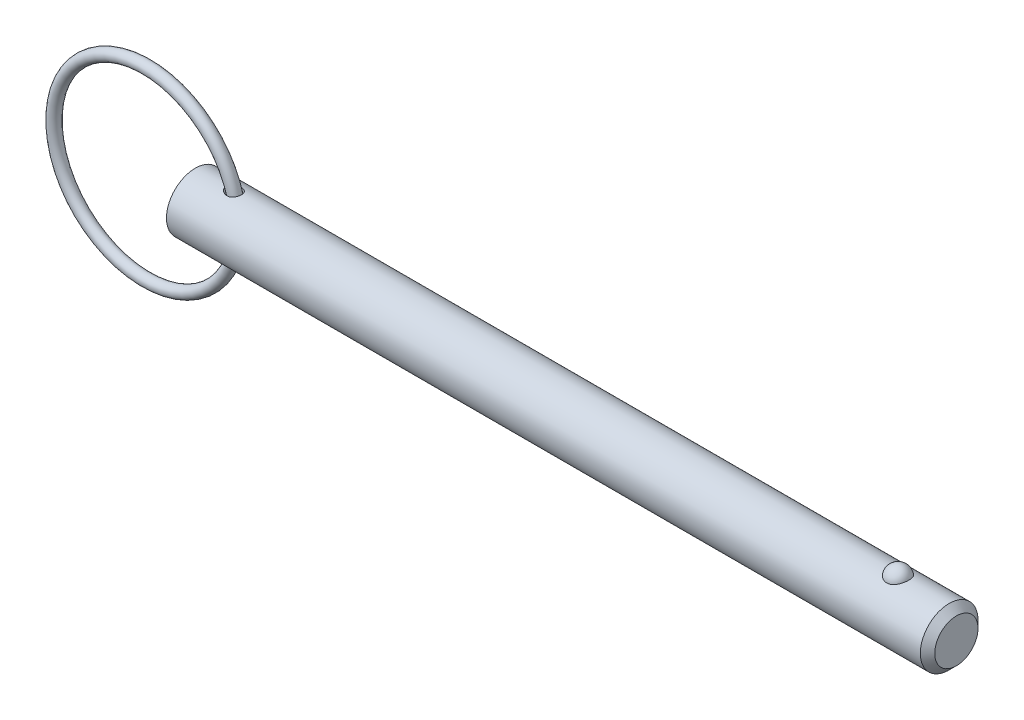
ISO-10303-21;
HEADER;
FILE_DESCRIPTION(('STEP AP214'),'2;1');
FILE_NAME('part.step','',(''),(''),'','','');
FILE_SCHEMA(('AUTOMOTIVE_DESIGN { 1 0 10303 214 1 1 1 1 }'));
ENDSEC;
DATA;
#1=APPLICATION_CONTEXT('core data for automotive mechanical design processes');
#2=APPLICATION_PROTOCOL_DEFINITION('international standard','automotive_design',2000,#1);
#3=PRODUCT_CONTEXT('',#1,'mechanical');
#4=PRODUCT('Part','Part','',(#3));
#5=PRODUCT_RELATED_PRODUCT_CATEGORY('part','',(#4));
#6=PRODUCT_DEFINITION_FORMATION('','',#4);
#7=PRODUCT_DEFINITION_CONTEXT('part definition',#1,'design');
#8=PRODUCT_DEFINITION('design','',#6,#7);
#9=PRODUCT_DEFINITION_SHAPE('','',#8);
#10=(LENGTH_UNIT() NAMED_UNIT(*) SI_UNIT(.MILLI.,.METRE.));
#11=(NAMED_UNIT(*) PLANE_ANGLE_UNIT() SI_UNIT($,.RADIAN.));
#12=(NAMED_UNIT(*) SI_UNIT($,.STERADIAN.) SOLID_ANGLE_UNIT());
#13=UNCERTAINTY_MEASURE_WITH_UNIT(LENGTH_MEASURE(1.E-05),#10,'distance_accuracy_value','');
#14=(GEOMETRIC_REPRESENTATION_CONTEXT(3) GLOBAL_UNCERTAINTY_ASSIGNED_CONTEXT((#13)) GLOBAL_UNIT_ASSIGNED_CONTEXT((#10,
#11,#12)) REPRESENTATION_CONTEXT('',''));
#15=CARTESIAN_POINT('',(0.,0.,0.));
#16=DIRECTION('',(0.,0.,1.));
#17=DIRECTION('',(1.,0.,0.));
#18=AXIS2_PLACEMENT_3D('',#15,#16,#17);
#19=CARTESIAN_POINT('',(-6.75433730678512,0.,0.));
#20=DIRECTION('',(0.,0.,1.));
#21=DIRECTION('',(1.,0.,0.));
#22=AXIS2_PLACEMENT_3D('',#19,#20,#21);
#23=TOROIDAL_SURFACE('',#22,12.7,0.794);
#24=CARTESIAN_POINT('',(6.73966269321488,0.,0.));
#25=VERTEX_POINT('',#24);
#26=VERTEX_LOOP('',#25);
#27=FACE_BOUND('',#26,.T.);
#28=ADVANCED_FACE('P0_F12',(#27),#23,.T.);
#29=CLOSED_SHELL('',(#28));
#30=MANIFOLD_SOLID_BREP('P0_B1',#29);
#31=CARTESIAN_POINT('',(0.,0.,0.));
#32=DIRECTION('',(1.,0.,0.));
#33=DIRECTION('',(0.,0.,-1.));
#34=AXIS2_PLACEMENT_3D('',#31,#32,#33);
#35=CYLINDRICAL_SURFACE('',#34,3.97);
#36=CARTESIAN_POINT('',(4.47423598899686,3.9272127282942,-0.581291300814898));
#37=CARTESIAN_POINT('',(4.51402362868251,3.92000695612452,-0.62997219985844));
#38=CARTESIAN_POINT('',(4.55825642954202,3.91241085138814,-0.675032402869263));
#39=CARTESIAN_POINT('',(4.65378532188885,3.8973704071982,-0.757069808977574));
#40=CARTESIAN_POINT('',(4.70509780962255,3.88992646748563,-0.794027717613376));
#41=CARTESIAN_POINT('',(4.81300878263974,3.87608600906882,-0.859045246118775));
#42=CARTESIAN_POINT('',(4.86959180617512,3.86968656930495,-0.887129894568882));
#43=CARTESIAN_POINT('',(4.98666757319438,3.85867771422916,-0.933854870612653));
#44=CARTESIAN_POINT('',(5.04715829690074,3.85406738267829,-0.952500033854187));
#45=CARTESIAN_POINT('',(5.17222686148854,3.84716625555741,-0.980011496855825));
#46=CARTESIAN_POINT('',(5.23687124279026,3.84494236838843,-0.988596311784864));
#47=CARTESIAN_POINT('',(5.36671178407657,3.84347581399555,-0.994286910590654));
#48=CARTESIAN_POINT('',(5.43190770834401,3.84423193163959,-0.991397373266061));
#49=CARTESIAN_POINT('',(5.5560514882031,3.84859691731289,-0.974304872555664));
#50=CARTESIAN_POINT('',(5.61511712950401,3.85200226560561,-0.960908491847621));
#51=CARTESIAN_POINT('',(5.72974412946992,3.8610605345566,-0.923836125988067));
#52=CARTESIAN_POINT('',(5.78530708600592,3.86671242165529,-0.90016486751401));
#53=CARTESIAN_POINT('',(5.88712740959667,3.87908259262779,-0.845190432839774));
#54=CARTESIAN_POINT('',(5.93376792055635,3.88569301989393,-0.814569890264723));
#55=CARTESIAN_POINT('',(6.02101503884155,3.89947732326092,-0.745789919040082));
#56=CARTESIAN_POINT('',(6.06162229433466,3.90665113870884,-0.707631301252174));
#57=CARTESIAN_POINT('',(6.13496290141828,3.9206013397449,-0.625680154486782));
#58=CARTESIAN_POINT('',(6.16783367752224,3.92738273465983,-0.582011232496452));
#59=CARTESIAN_POINT('',(6.2258925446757,3.93995609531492,-0.489706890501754));
#60=CARTESIAN_POINT('',(6.25108046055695,3.94574803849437,-0.441071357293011));
#61=CARTESIAN_POINT('',(6.29336449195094,3.95576358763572,-0.339770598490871));
#62=CARTESIAN_POINT('',(6.31039150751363,3.95997373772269,-0.28707520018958));
#63=CARTESIAN_POINT('',(6.33565624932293,3.96630600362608,-0.179496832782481));
#64=CARTESIAN_POINT('',(6.34389366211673,3.96842804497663,-0.124613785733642));
#65=CARTESIAN_POINT('',(6.35142037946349,3.97036465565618,-0.0138440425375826));
#66=CARTESIAN_POINT('',(6.35065227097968,3.97016441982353,0.0420468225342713));
#67=CARTESIAN_POINT('',(6.34004566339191,3.96744188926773,0.152904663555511));
#68=CARTESIAN_POINT('',(6.33020697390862,3.96491954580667,0.207871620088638));
#69=CARTESIAN_POINT('',(6.30166659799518,3.95782104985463,0.315369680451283));
#70=CARTESIAN_POINT('',(6.28295698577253,3.95324306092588,0.36789855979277));
#71=CARTESIAN_POINT('',(6.23710200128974,3.94253162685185,0.468965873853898));
#72=CARTESIAN_POINT('',(6.20995670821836,3.93639819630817,0.517504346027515));
#73=CARTESIAN_POINT('',(6.14798638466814,3.92327702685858,0.609041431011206));
#74=CARTESIAN_POINT('',(6.11318666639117,3.91629213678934,0.652057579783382));
#75=CARTESIAN_POINT('',(6.03675089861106,3.90223639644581,0.731492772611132));
#76=CARTESIAN_POINT('',(5.99511563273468,3.89516555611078,0.767912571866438));
#77=CARTESIAN_POINT('',(5.90657479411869,3.88180215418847,0.832828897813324));
#78=CARTESIAN_POINT('',(5.85972260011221,3.87550288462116,0.86139687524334));
#79=CARTESIAN_POINT('',(5.76177854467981,3.86429747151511,0.910350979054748));
#80=CARTESIAN_POINT('',(5.71068697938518,3.8593912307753,0.930737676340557));
#81=CARTESIAN_POINT('',(5.60571987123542,3.85147434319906,0.962976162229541));
#82=CARTESIAN_POINT('',(5.55184284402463,3.84846471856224,0.974823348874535));
#83=CARTESIAN_POINT('',(5.44283210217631,3.84460058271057,0.989953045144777));
#84=CARTESIAN_POINT('',(5.38769814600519,3.84374648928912,0.99323389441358));
#85=CARTESIAN_POINT('',(5.27524330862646,3.84420584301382,0.991454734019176));
#86=CARTESIAN_POINT('',(5.21792896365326,3.84561285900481,0.986034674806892));
#87=CARTESIAN_POINT('',(5.1048579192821,3.85052758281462,0.966661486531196));
#88=CARTESIAN_POINT('',(5.04910180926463,3.85403607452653,0.952705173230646));
#89=CARTESIAN_POINT('',(4.93593174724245,3.86308835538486,0.915340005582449));
#90=CARTESIAN_POINT('',(4.8787523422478,3.86877458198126,0.891254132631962));
#91=CARTESIAN_POINT('',(4.7690169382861,3.88143650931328,0.83438431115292));
#92=CARTESIAN_POINT('',(4.71646372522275,3.88841297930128,0.801595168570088));
#93=CARTESIAN_POINT('',(4.61492504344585,3.90324173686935,0.726056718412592));
#94=CARTESIAN_POINT('',(4.56625259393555,3.91112043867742,0.682888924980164));
#95=CARTESIAN_POINT('',(4.47749220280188,3.92644930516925,0.588370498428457));
#96=CARTESIAN_POINT('',(4.43740132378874,3.93389961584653,0.537022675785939));
#97=CARTESIAN_POINT('',(4.37035516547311,3.94686586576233,0.431042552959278));
#98=CARTESIAN_POINT('',(4.34268823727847,3.95247934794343,0.376876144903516));
#99=CARTESIAN_POINT('',(4.29855851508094,3.96161331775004,0.264011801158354));
#100=CARTESIAN_POINT('',(4.28207681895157,3.96513733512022,0.20532169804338));
#101=CARTESIAN_POINT('',(4.26319409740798,3.96919493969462,0.094762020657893));
#102=CARTESIAN_POINT('',(4.25904206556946,3.97009986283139,0.0432014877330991));
#103=CARTESIAN_POINT('',(4.26004223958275,3.9698827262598,-0.0598293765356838));
#104=CARTESIAN_POINT('',(4.26519288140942,3.96876100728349,-0.111299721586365));
#105=CARTESIAN_POINT('',(4.28369027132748,3.96479623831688,-0.208517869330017));
#106=CARTESIAN_POINT('',(4.29637416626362,3.96209263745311,-0.25440084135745));
#107=CARTESIAN_POINT('',(4.32867922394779,3.95536287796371,-0.343510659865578));
#108=CARTESIAN_POINT('',(4.34829584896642,3.95133758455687,-0.386739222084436));
#109=CARTESIAN_POINT('',(4.38573190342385,3.94389838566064,-0.455314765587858));
#110=CARTESIAN_POINT('',(4.40181371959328,3.94075686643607,-0.481662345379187));
#111=CARTESIAN_POINT('',(4.43632024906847,3.93417901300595,-0.532726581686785));
#112=CARTESIAN_POINT('',(4.45474473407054,3.93074270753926,-0.557443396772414));
#113=CARTESIAN_POINT('',(4.47423598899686,3.9272127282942,-0.581291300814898));
#114=B_SPLINE_CURVE_WITH_KNOTS('',3,(#36,#37,#38,#39,#40,#41,#42,#43,#44,#45,#46,#47,#48,#49,
#50,#51,#52,#53,#54,#55,#56,#57,#58,#59,#60,#61,#62,#63,#64,#65,#66,#67,#68,#69,#70,#71,#72,#73,
#74,#75,#76,#77,#78,#79,#80,#81,#82,#83,#84,#85,#86,#87,#88,#89,#90,#91,#92,#93,#94,#95,#96,#97,
#98,#99,#100,#101,#102,#103,#104,#105,#106,#107,#108,#109,#110,#111,#112,#113),.UNSPECIFIED.,
.T.,.F.,(4,2,2,2,2,2,2,2,2,2,2,2,2,2,2,2,2,2,2,2,2,2,2,2,2,2,2,2,2,2,2,2,2,2,2,2,2,2,4),(0.,
0.189730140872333,0.379907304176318,0.569543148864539,0.759081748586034,0.953805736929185,
1.148450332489,1.32946176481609,1.51039001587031,1.67812095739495,1.84583386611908,
2.01029437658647,2.17475863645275,2.34059186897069,2.50643101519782,2.67332801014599,
2.84022850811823,3.00727840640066,3.17432673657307,3.34083074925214,3.50731568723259,
3.67223129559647,3.83713539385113,4.00212829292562,4.16715316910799,4.33918465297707,
4.5112803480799,4.69738596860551,4.88360290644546,5.07919911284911,5.27472826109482,
5.45686425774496,5.63869168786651,5.79305070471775,5.94738377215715,6.08981233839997,
6.2321478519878,6.3251023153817,6.4180477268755),.UNSPECIFIED.);
#115=CARTESIAN_POINT('',(4.47423598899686,3.9272127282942,-0.581291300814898));
#116=VERTEX_POINT('',#115);
#117=EDGE_CURVE('P1_E40',#116,#116,#114,.T.);
#118=ORIENTED_EDGE('',*,*,#117,.T.);
#119=EDGE_LOOP('',(#118));
#120=FACE_BOUND('',#119,.T.);
#121=CARTESIAN_POINT('',(103.7875,0.,0.));
#122=DIRECTION('',(1.,0.,0.));
#123=DIRECTION('',(0.,0.,-1.));
#124=AXIS2_PLACEMENT_3D('',#121,#122,#123);
#125=CIRCLE('',#124,3.97);
#126=CARTESIAN_POINT('',(103.7875,0.,-3.97));
#127=VERTEX_POINT('',#126);
#128=EDGE_CURVE('P1_E25',#127,#127,#125,.T.);
#129=ORIENTED_EDGE('',*,*,#128,.F.);
#130=EDGE_LOOP('',(#129));
#131=FACE_BOUND('',#130,.T.);
#132=CARTESIAN_POINT('',(0.,0.,0.));
#133=DIRECTION('',(1.,0.,0.));
#134=DIRECTION('',(0.,0.,-1.));
#135=AXIS2_PLACEMENT_3D('',#132,#133,#134);
#136=CIRCLE('',#135,3.97);
#137=CARTESIAN_POINT('',(0.,0.,-3.97));
#138=VERTEX_POINT('',#137);
#139=EDGE_CURVE('P1_E9',#138,#138,#136,.T.);
#140=ORIENTED_EDGE('',*,*,#139,.T.);
#141=EDGE_LOOP('',(#140));
#142=FACE_BOUND('',#141,.T.);
#143=CARTESIAN_POINT('',(96.7451922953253,3.65715365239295,1.5447094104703));
#144=CARTESIAN_POINT('',(96.6652448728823,3.65716001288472,1.54470290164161));
#145=CARTESIAN_POINT('',(96.5851650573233,3.65987074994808,1.53832549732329));
#146=CARTESIAN_POINT('',(96.4272374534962,3.6704221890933,1.51297018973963));
#147=CARTESIAN_POINT('',(96.3493961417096,3.67827646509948,1.49395894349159));
#148=CARTESIAN_POINT('',(96.1984614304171,3.69818848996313,1.4439595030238));
#149=CARTESIAN_POINT('',(96.1253560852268,3.71023513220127,1.41300293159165));
#150=CARTESIAN_POINT('',(95.9855630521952,3.7372183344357,1.34000212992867));
#151=CARTESIAN_POINT('',(95.9188725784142,3.75215363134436,1.29796274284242));
#152=CARTESIAN_POINT('',(95.79148864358,3.78384968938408,1.20248834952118));
#153=CARTESIAN_POINT('',(95.7310299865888,3.80065129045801,1.14875388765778));
#154=CARTESIAN_POINT('',(95.6196942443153,3.83398532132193,1.03205417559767));
#155=CARTESIAN_POINT('',(95.5688200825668,3.85051766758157,0.969086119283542));
#156=CARTESIAN_POINT('',(95.4756321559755,3.88238608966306,0.832526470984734));
#157=CARTESIAN_POINT('',(95.4337961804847,3.89763698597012,0.758588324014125));
#158=CARTESIAN_POINT('',(95.3625108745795,3.92451063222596,0.604352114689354));
#159=CARTESIAN_POINT('',(95.3330623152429,3.93613315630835,0.52405365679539));
#160=CARTESIAN_POINT('',(95.2868927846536,3.95467606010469,0.358403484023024));
#161=CARTESIAN_POINT('',(95.2703127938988,3.96154426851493,0.273006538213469));
#162=CARTESIAN_POINT('',(95.250756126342,3.96967008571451,0.100408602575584));
#163=CARTESIAN_POINT('',(95.2477789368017,3.97092790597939,0.013207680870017));
#164=CARTESIAN_POINT('',(95.2554587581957,3.96771794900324,-0.159844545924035));
#165=CARTESIAN_POINT('',(95.2660164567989,3.96329187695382,-0.245701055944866));
#166=CARTESIAN_POINT('',(95.3003800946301,3.94923163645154,-0.41427746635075));
#167=CARTESIAN_POINT('',(95.3241862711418,3.93959737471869,-0.496997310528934));
#168=CARTESIAN_POINT('',(95.3846114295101,3.91607752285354,-0.657113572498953));
#169=CARTESIAN_POINT('',(95.4212495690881,3.90218558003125,-0.734501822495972));
#170=CARTESIAN_POINT('',(95.5065935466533,3.87158287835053,-0.881704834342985));
#171=CARTESIAN_POINT('',(95.5553004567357,3.8548718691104,-0.951518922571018));
#172=CARTESIAN_POINT('',(95.6641161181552,3.82028735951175,-1.08208159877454));
#173=CARTESIAN_POINT('',(95.7242955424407,3.80240713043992,-1.14276958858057));
#174=CARTESIAN_POINT('',(95.854493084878,3.76758161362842,-1.2528243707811));
#175=CARTESIAN_POINT('',(95.9245105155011,3.75063626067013,-1.30219195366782));
#176=CARTESIAN_POINT('',(96.07118160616,3.71998948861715,-1.38729709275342));
#177=CARTESIAN_POINT('',(96.1476813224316,3.70623183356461,-1.42327904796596));
#178=CARTESIAN_POINT('',(96.3062981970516,3.68323188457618,-1.48178996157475));
#179=CARTESIAN_POINT('',(96.3884132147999,3.67398788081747,-1.50432401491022));
#180=CARTESIAN_POINT('',(96.5514810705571,3.6615216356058,-1.53440939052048));
#181=CARTESIAN_POINT('',(96.6322840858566,3.65801951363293,-1.54265826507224));
#182=CARTESIAN_POINT('',(96.7942085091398,3.65657341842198,-1.54608423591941));
#183=CARTESIAN_POINT('',(96.8753298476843,3.65862829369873,-1.5412640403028));
#184=CARTESIAN_POINT('',(97.0328122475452,3.66788969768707,-1.51908474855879));
#185=CARTESIAN_POINT('',(97.1092422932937,3.67492621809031,-1.50213925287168));
#186=CARTESIAN_POINT('',(97.2580412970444,3.69318404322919,-1.4566698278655));
#187=CARTESIAN_POINT('',(97.3304099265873,3.7044056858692,-1.42814496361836));
#188=CARTESIAN_POINT('',(97.4708029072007,3.73012749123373,-1.35956319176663));
#189=CARTESIAN_POINT('',(97.5387000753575,3.74469307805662,-1.31927107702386));
#190=CARTESIAN_POINT('',(97.6668649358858,3.77545272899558,-1.22847440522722));
#191=CARTESIAN_POINT('',(97.7271308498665,3.79164717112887,-1.17796747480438));
#192=CARTESIAN_POINT('',(97.8416346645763,3.82490325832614,-1.06519260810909));
#193=CARTESIAN_POINT('',(97.8954137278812,3.84196735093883,-1.00245914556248));
#194=CARTESIAN_POINT('',(97.9920988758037,3.87439863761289,-0.86871586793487));
#195=CARTESIAN_POINT('',(98.0350030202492,3.88976552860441,-0.79770457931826));
#196=CARTESIAN_POINT('',(98.110266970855,3.91771381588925,-0.646896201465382));
#197=CARTESIAN_POINT('',(98.1422532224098,3.93019255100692,-0.566893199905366));
#198=CARTESIAN_POINT('',(98.1931101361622,3.95043886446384,-0.402255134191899));
#199=CARTESIAN_POINT('',(98.2119807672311,3.95820643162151,-0.31762005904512));
#200=CARTESIAN_POINT('',(98.2362162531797,3.96823733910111,-0.146156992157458));
#201=CARTESIAN_POINT('',(98.2415874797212,3.970503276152,-0.0593300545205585));
#202=CARTESIAN_POINT('',(98.2387309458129,3.96930811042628,0.114057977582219));
#203=CARTESIAN_POINT('',(98.2305035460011,3.9658471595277,0.200619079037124));
#204=CARTESIAN_POINT('',(98.2007063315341,3.95358562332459,0.370506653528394));
#205=CARTESIAN_POINT('',(98.1792129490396,3.94481563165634,0.453848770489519));
#206=CARTESIAN_POINT('',(98.1233839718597,3.92284586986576,0.615497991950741));
#207=CARTESIAN_POINT('',(98.0890474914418,3.90964579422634,0.69380474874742));
#208=CARTESIAN_POINT('',(98.0079702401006,3.88006987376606,0.843703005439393));
#209=CARTESIAN_POINT('',(97.9611536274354,3.86367478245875,0.915249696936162));
#210=CARTESIAN_POINT('',(97.8561897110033,3.82949741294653,1.04910810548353));
#211=CARTESIAN_POINT('',(97.7980428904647,3.81171519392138,1.1114202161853));
#212=CARTESIAN_POINT('',(97.6717433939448,3.77673366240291,1.22503948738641));
#213=CARTESIAN_POINT('',(97.6035970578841,3.75953398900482,1.27635357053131));
#214=CARTESIAN_POINT('',(97.4589009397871,3.72770506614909,1.36653336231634));
#215=CARTESIAN_POINT('',(97.382348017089,3.7130767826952,1.40539439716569));
#216=CARTESIAN_POINT('',(97.2257594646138,3.68864287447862,1.46830480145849));
#217=CARTESIAN_POINT('',(97.1459307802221,3.67869017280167,1.49281289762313));
#218=CARTESIAN_POINT('',(96.9829877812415,3.66414535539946,1.52817474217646));
#219=CARTESIAN_POINT('',(96.8998840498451,3.65953723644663,1.53906926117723));
#220=CARTESIAN_POINT('',(96.7927760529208,3.6573894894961,1.54414878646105));
#221=CARTESIAN_POINT('',(96.7689900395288,3.65715175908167,1.54471134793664));
#222=CARTESIAN_POINT('',(96.7451922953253,3.65715365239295,1.5447094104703));
#223=B_SPLINE_CURVE_WITH_KNOTS('',3,(#143,#144,#145,#146,#147,#148,#149,#150,#151,#152,#153,
#154,#155,#156,#157,#158,#159,#160,#161,#162,#163,#164,#165,#166,#167,#168,#169,#170,#171,#172,
#173,#174,#175,#176,#177,#178,#179,#180,#181,#182,#183,#184,#185,#186,#187,#188,#189,#190,#191,
#192,#193,#194,#195,#196,#197,#198,#199,#200,#201,#202,#203,#204,#205,#206,#207,#208,#209,#210,
#211,#212,#213,#214,#215,#216,#217,#218,#219,#220,#221,#222),.UNSPECIFIED.,.T.,.F.,(4,2,2,2,2,2,
2,2,2,2,2,2,2,2,2,2,2,2,2,2,2,2,2,2,2,2,2,2,2,2,2,2,2,2,2,2,2,2,2,4),(0.,0.239777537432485,
0.480190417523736,0.719971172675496,0.9596473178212,1.20639040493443,1.45320863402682,
1.71093679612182,1.9686809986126,2.22921052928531,2.48973023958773,2.74834928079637,
3.00697295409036,3.26598440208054,3.52501886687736,3.78570385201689,4.04637062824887,
4.30201257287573,4.55755760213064,4.80022994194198,5.04285200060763,5.27757006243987,
5.51230707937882,5.7521012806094,5.99195126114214,6.24392810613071,6.49594987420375,
6.75588818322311,7.01582710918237,7.27564332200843,7.5354526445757,7.79377886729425,
8.05212290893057,8.31207418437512,8.57201437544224,8.83179046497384,9.09166393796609,
9.34270057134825,9.59298357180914,9.66435753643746),.UNSPECIFIED.);
#224=CARTESIAN_POINT('',(96.7451922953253,3.65715365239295,1.5447094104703));
#225=VERTEX_POINT('',#224);
#226=EDGE_CURVE('P1_E34',#225,#225,#223,.T.);
#227=ORIENTED_EDGE('',*,*,#226,.T.);
#228=EDGE_LOOP('',(#227));
#229=FACE_BOUND('',#228,.T.);
#230=CARTESIAN_POINT('',(4.47423598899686,-3.9272127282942,-0.581291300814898));
#231=CARTESIAN_POINT('',(4.44128910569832,-3.93317954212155,-0.540978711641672));
#232=CARTESIAN_POINT('',(4.41136828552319,-3.93888228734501,-0.498159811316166));
#233=CARTESIAN_POINT('',(4.35872676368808,-3.94921939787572,-0.408179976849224));
#234=CARTESIAN_POINT('',(4.33600082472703,-3.95385453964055,-0.36102223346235));
#235=CARTESIAN_POINT('',(4.29878526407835,-3.9615772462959,-0.263108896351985));
#236=CARTESIAN_POINT('',(4.28434166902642,-3.96465615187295,-0.212334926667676));
#237=CARTESIAN_POINT('',(4.26481927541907,-3.96884157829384,-0.108934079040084));
#238=CARTESIAN_POINT('',(4.25973608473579,-3.96994902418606,-0.0563080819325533));
#239=CARTESIAN_POINT('',(4.25930094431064,-3.97004379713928,0.0449240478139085));
#240=CARTESIAN_POINT('',(4.26323134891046,-3.96918747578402,0.0935283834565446));
#241=CARTESIAN_POINT('',(4.27911923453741,-3.96577236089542,0.189336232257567));
#242=CARTESIAN_POINT('',(4.29107713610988,-3.96321347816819,0.236539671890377));
#243=CARTESIAN_POINT('',(4.3222019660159,-3.95670052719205,0.327873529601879));
#244=CARTESIAN_POINT('',(4.34129939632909,-3.95275993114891,0.37202886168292));
#245=CARTESIAN_POINT('',(4.38584298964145,-3.94385347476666,0.456884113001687));
#246=CARTESIAN_POINT('',(4.41129114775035,-3.93888729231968,0.497582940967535));
#247=CARTESIAN_POINT('',(4.47067915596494,-3.92777410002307,0.57910486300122));
#248=CARTESIAN_POINT('',(4.50523982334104,-3.92155746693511,0.61946509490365));
#249=CARTESIAN_POINT('',(4.57989786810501,-3.90894004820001,0.694653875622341));
#250=CARTESIAN_POINT('',(4.61999845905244,-3.90253915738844,0.729479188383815));
#251=CARTESIAN_POINT('',(4.7106931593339,-3.88921622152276,0.79766500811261));
#252=CARTESIAN_POINT('',(4.76196990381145,-3.88234748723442,0.830130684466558));
#253=CARTESIAN_POINT('',(4.86907659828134,-3.86980743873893,0.886754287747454));
#254=CARTESIAN_POINT('',(4.92490895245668,-3.86413676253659,0.91090779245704));
#255=CARTESIAN_POINT('',(5.04387274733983,-3.85430959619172,0.951667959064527));
#256=CARTESIAN_POINT('',(5.10724127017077,-3.85028805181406,0.967622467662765));
#257=CARTESIAN_POINT('',(5.23589558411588,-3.84499084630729,0.988466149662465));
#258=CARTESIAN_POINT('',(5.30118075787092,-3.84371431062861,0.993358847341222));
#259=CARTESIAN_POINT('',(5.42870419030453,-3.84421020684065,0.991437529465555));
#260=CARTESIAN_POINT('',(5.49094970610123,-3.84585050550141,0.985130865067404));
#261=CARTESIAN_POINT('',(5.61317445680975,-3.85182888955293,0.961489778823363));
#262=CARTESIAN_POINT('',(5.67315499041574,-3.85616540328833,0.944161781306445));
#263=CARTESIAN_POINT('',(5.78385047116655,-3.86655540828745,0.900611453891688));
#264=CARTESIAN_POINT('',(5.83492113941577,-3.87243611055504,0.875248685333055));
#265=CARTESIAN_POINT('',(5.93173444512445,-3.88533932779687,0.816058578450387));
#266=CARTESIAN_POINT('',(5.97747806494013,-3.89236163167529,0.78223280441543));
#267=CARTESIAN_POINT('',(6.06067538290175,-3.90644082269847,0.708499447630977));
#268=CARTESIAN_POINT('',(6.09837515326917,-3.9134865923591,0.668866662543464));
#269=CARTESIAN_POINT('',(6.16659675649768,-3.92708124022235,0.583768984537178));
#270=CARTESIAN_POINT('',(6.19711866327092,-3.93363012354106,0.538304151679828));
#271=CARTESIAN_POINT('',(6.25033980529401,-3.94554016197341,0.44265233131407));
#272=CARTESIAN_POINT('',(6.27301093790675,-3.95089702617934,0.392449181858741));
#273=CARTESIAN_POINT('',(6.3098605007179,-3.95981777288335,0.288866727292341));
#274=CARTESIAN_POINT('',(6.32403857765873,-3.96338158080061,0.235487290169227));
#275=CARTESIAN_POINT('',(6.34366897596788,-3.96835894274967,0.126579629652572));
#276=CARTESIAN_POINT('',(6.34904619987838,-3.9697539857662,0.0710370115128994));
#277=CARTESIAN_POINT('',(6.35072157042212,-3.97018611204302,-0.0401947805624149));
#278=CARTESIAN_POINT('',(6.34701950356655,-3.96922313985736,-0.0958839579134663));
#279=CARTESIAN_POINT('',(6.33059893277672,-3.96503727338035,-0.205963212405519));
#280=CARTESIAN_POINT('',(6.31785949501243,-3.96180913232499,-0.260349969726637));
#281=CARTESIAN_POINT('',(6.28362857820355,-3.95343617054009,-0.366141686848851));
#282=CARTESIAN_POINT('',(6.26213701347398,-3.94829133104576,-0.417546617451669));
#283=CARTESIAN_POINT('',(6.21094198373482,-3.93665740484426,-0.515825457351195));
#284=CARTESIAN_POINT('',(6.18125109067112,-3.93017037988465,-0.562706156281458));
#285=CARTESIAN_POINT('',(6.11437296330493,-3.91656890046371,-0.650670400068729));
#286=CARTESIAN_POINT('',(6.07718632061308,-3.90945449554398,-0.691754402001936));
#287=CARTESIAN_POINT('',(5.99660825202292,-3.89545704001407,-0.76665430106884));
#288=CARTESIAN_POINT('',(5.95326700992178,-3.88857262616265,-0.800523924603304));
#289=CARTESIAN_POINT('',(5.86137696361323,-3.87574946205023,-0.860470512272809));
#290=CARTESIAN_POINT('',(5.81282877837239,-3.86981059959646,-0.886548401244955));
#291=CARTESIAN_POINT('',(5.71225875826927,-3.85955823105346,-0.93016771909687));
#292=CARTESIAN_POINT('',(5.6602610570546,-3.85523459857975,-0.947762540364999));
#293=CARTESIAN_POINT('',(5.55400860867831,-3.84858369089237,-0.974419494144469));
#294=CARTESIAN_POINT('',(5.49975362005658,-3.84625662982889,-0.983480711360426));
#295=CARTESIAN_POINT('',(5.38905619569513,-3.84373902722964,-0.99327593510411));
#296=CARTESIAN_POINT('',(5.33259335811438,-3.8436048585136,-0.993790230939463));
#297=CARTESIAN_POINT('',(5.22028568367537,-3.84553679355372,-0.986285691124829));
#298=CARTESIAN_POINT('',(5.16444101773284,-3.84760349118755,-0.978264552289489));
#299=CARTESIAN_POINT('',(5.05063804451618,-3.85386728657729,-0.953301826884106));
#300=CARTESIAN_POINT('',(4.99282059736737,-3.85820814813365,-0.935754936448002));
#301=CARTESIAN_POINT('',(4.88067115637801,-3.86855108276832,-0.89202836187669));
#302=CARTESIAN_POINT('',(4.82634209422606,-3.87455453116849,-0.865841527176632));
#303=CARTESIAN_POINT('',(4.71735796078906,-3.8882057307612,-0.802439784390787));
#304=CARTESIAN_POINT('',(4.66319676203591,-3.89595714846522,-0.764393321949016));
#305=CARTESIAN_POINT('',(4.5624904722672,-3.9116844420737,-0.679328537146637));
#306=CARTESIAN_POINT('',(4.51593909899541,-3.9196601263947,-0.632317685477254));
#307=CARTESIAN_POINT('',(4.47423598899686,-3.9272127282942,-0.581291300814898));
#308=B_SPLINE_CURVE_WITH_KNOTS('',3,(#230,#231,#232,#233,#234,#235,#236,#237,#238,#239,#240,
#241,#242,#243,#244,#245,#246,#247,#248,#249,#250,#251,#252,#253,#254,#255,#256,#257,#258,#259,
#260,#261,#262,#263,#264,#265,#266,#267,#268,#269,#270,#271,#272,#273,#274,#275,#276,#277,#278,
#279,#280,#281,#282,#283,#284,#285,#286,#287,#288,#289,#290,#291,#292,#293,#294,#295,#296,#297,
#298,#299,#300,#301,#302,#303,#304,#305,#306,#307),.UNSPECIFIED.,.T.,.F.,(4,2,2,2,2,2,2,2,2,2,2,
2,2,2,2,2,2,2,2,2,2,2,2,2,2,2,2,2,2,2,2,2,2,2,2,2,2,2,4),(0.,0.157032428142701,
0.313950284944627,0.47173191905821,0.629439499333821,0.775030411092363,0.920628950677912,
1.06484561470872,1.20910764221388,1.36897610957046,1.5289377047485,1.71139614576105,
1.89395150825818,2.08937788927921,2.28474199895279,2.4714801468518,2.65810954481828,
2.82921764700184,3.00029414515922,3.16497190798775,3.32964797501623,3.49490756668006,
3.66017403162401,3.82684349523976,3.99351687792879,4.16057760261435,4.3276399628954,
4.49444757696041,4.66124203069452,4.82674719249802,4.99223270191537,5.15666259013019,
5.32111011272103,5.48977863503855,5.6584926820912,5.83945443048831,6.02056632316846,
6.21949800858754,6.41826462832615),.UNSPECIFIED.);
#309=CARTESIAN_POINT('',(4.47423598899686,-3.9272127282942,-0.581291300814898));
#310=VERTEX_POINT('',#309);
#311=EDGE_CURVE('P1_E17',#310,#310,#308,.T.);
#312=ORIENTED_EDGE('',*,*,#311,.T.);
#313=EDGE_LOOP('',(#312));
#314=FACE_BOUND('',#313,.T.);
#315=ADVANCED_FACE('P1_F13',(#120,#131,#142,#229,#314),#35,.T.);
#316=CARTESIAN_POINT('',(0.,0.,0.));
#317=DIRECTION('',(-1.,0.,0.));
#318=DIRECTION('',(0.,0.,1.));
#319=AXIS2_PLACEMENT_3D('',#316,#317,#318);
#320=PLANE('',#319);
#321=ORIENTED_EDGE('',*,*,#139,.F.);
#322=EDGE_LOOP('',(#321));
#323=FACE_BOUND('',#322,.T.);
#324=ADVANCED_FACE('P1_F15',(#323),#320,.T.);
#325=CARTESIAN_POINT('',(104.78,0.,0.));
#326=DIRECTION('',(-1.,0.,0.));
#327=DIRECTION('',(0.,0.,1.));
#328=AXIS2_PLACEMENT_3D('',#325,#326,#327);
#329=CONICAL_SURFACE('',#328,2.97750000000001,0.785398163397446);
#330=ORIENTED_EDGE('',*,*,#128,.T.);
#331=EDGE_LOOP('',(#330));
#332=FACE_BOUND('',#331,.T.);
#333=CARTESIAN_POINT('',(104.78,0.,0.));
#334=DIRECTION('',(1.,0.,0.));
#335=DIRECTION('',(0.,0.,-1.));
#336=AXIS2_PLACEMENT_3D('',#333,#334,#335);
#337=CIRCLE('',#336,2.97750000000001);
#338=CARTESIAN_POINT('',(104.78,0.,-2.97750000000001));
#339=VERTEX_POINT('',#338);
#340=EDGE_CURVE('P1_E30',#339,#339,#337,.T.);
#341=ORIENTED_EDGE('',*,*,#340,.F.);
#342=EDGE_LOOP('',(#341));
#343=FACE_BOUND('',#342,.T.);
#344=ADVANCED_FACE('P1_F55',(#332,#343),#329,.T.);
#345=CARTESIAN_POINT('',(104.78,2.97750000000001,0.));
#346=DIRECTION('',(1.,0.,0.));
#347=DIRECTION('',(0.,0.,-1.));
#348=AXIS2_PLACEMENT_3D('',#345,#346,#347);
#349=PLANE('',#348);
#350=ORIENTED_EDGE('',*,*,#340,.T.);
#351=EDGE_LOOP('',(#350));
#352=FACE_BOUND('',#351,.T.);
#353=ADVANCED_FACE('P1_F51',(#352),#349,.T.);
#354=CARTESIAN_POINT('',(96.7451922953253,3.573,0.));
#355=DIRECTION('',(-1.,0.,0.));
#356=DIRECTION('',(0.,1.,0.));
#357=AXIS2_PLACEMENT_3D('',#354,#355,#356);
#358=SPHERICAL_SURFACE('',#357,1.54700000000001);
#359=ORIENTED_EDGE('',*,*,#226,.F.);
#360=EDGE_LOOP('',(#359));
#361=FACE_BOUND('',#360,.T.);
#362=ADVANCED_FACE('P1_F46',(#361),#358,.T.);
#363=CARTESIAN_POINT('',(-6.75433730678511,0.,0.));
#364=DIRECTION('',(0.,0.,1.));
#365=DIRECTION('',(1.,0.,0.));
#366=AXIS2_PLACEMENT_3D('',#363,#364,#365);
#367=TOROIDAL_SURFACE('',#366,12.7,0.9925);
#368=ORIENTED_EDGE('',*,*,#311,.F.);
#369=EDGE_LOOP('',(#368));
#370=FACE_BOUND('',#369,.T.);
#371=ORIENTED_EDGE('',*,*,#117,.F.);
#372=EDGE_LOOP('',(#371));
#373=FACE_BOUND('',#372,.T.);
#374=ADVANCED_FACE('P1_F50',(#370,#373),#367,.F.);
#375=CLOSED_SHELL('',(#315,#324,#344,#353,#362,#374));
#376=MANIFOLD_SOLID_BREP('P1_B1',#375);
#377=ADVANCED_BREP_SHAPE_REPRESENTATION('',(#18,#30,#376),#14);
#378=SHAPE_DEFINITION_REPRESENTATION(#9,#377);
ENDSEC;
END-ISO-10303-21;
